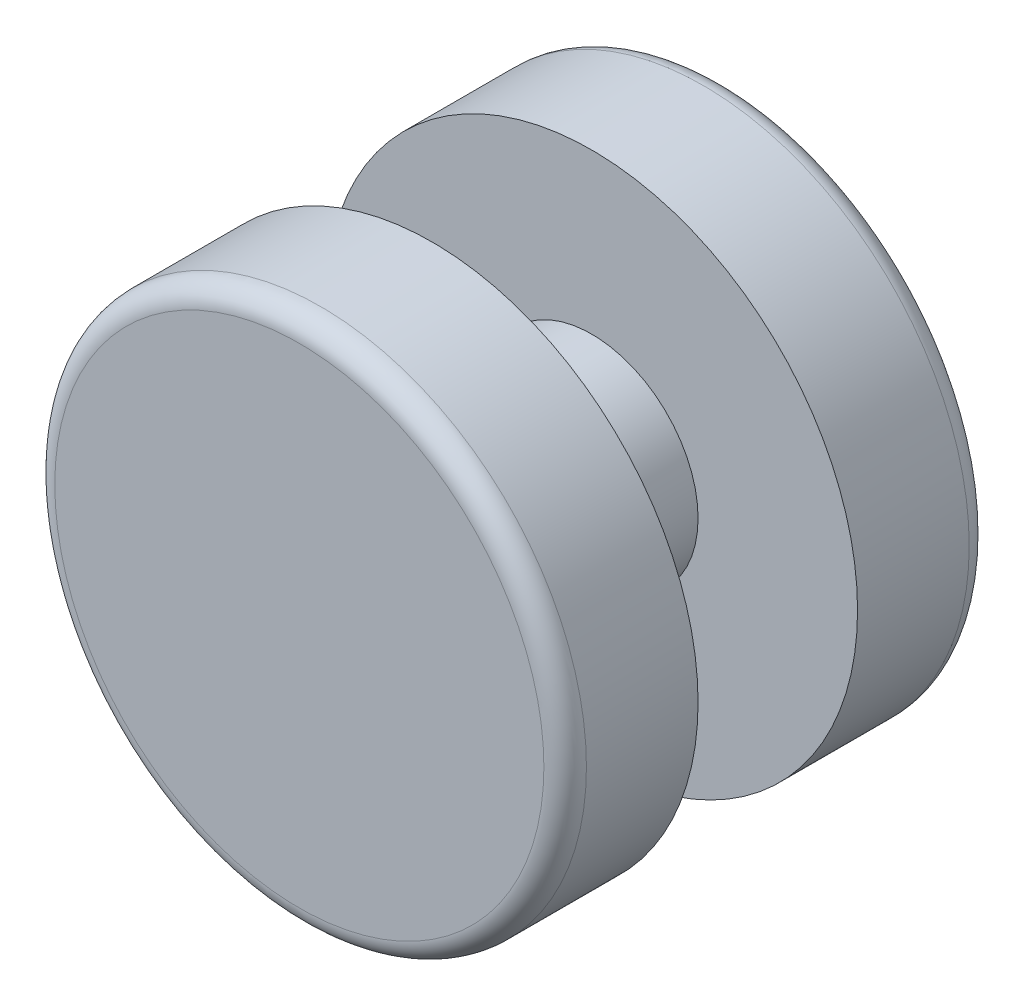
from build123d import *

# Parameters (mm, degrees)
ESQUISSE1_R             = 2.5
BASE_EXTRUSION_DEPTH    = 2
ESQUISSE2_R             = 5
ESQUISSE2_R_2           = 1
ENL_V_MAT_EXTRU_1_DEPTH = 0.75
CONG_1_R                = 0.2


with BuildPart() as part:
    # Esquisse1 → Base-Extrusion (new, symmetric)
    with BuildSketch(Plane.XY):
        Circle(ESQUISSE1_R)
    extrude(amount=BASE_EXTRUSION_DEPTH, both=True)

    # Esquisse2 → Enl_v. mat.-Extru.1 (cut, symmetric)
    with BuildSketch(Plane.XY):
        Circle(ESQUISSE2_R)
        Circle(ESQUISSE2_R_2, mode=Mode.SUBTRACT)
    extrude(amount=ENL_V_MAT_EXTRU_1_DEPTH, both=True, mode=Mode.SUBTRACT)

    # Cong_1
    cong_1_edges = [part.edges().sort_by_distance(p)[0] for p in [
        (-2.5, 0, -2),
        (-2.5, 0, 2),
    ]]
    fillet(cong_1_edges, radius=CONG_1_R)


solid = part.part
